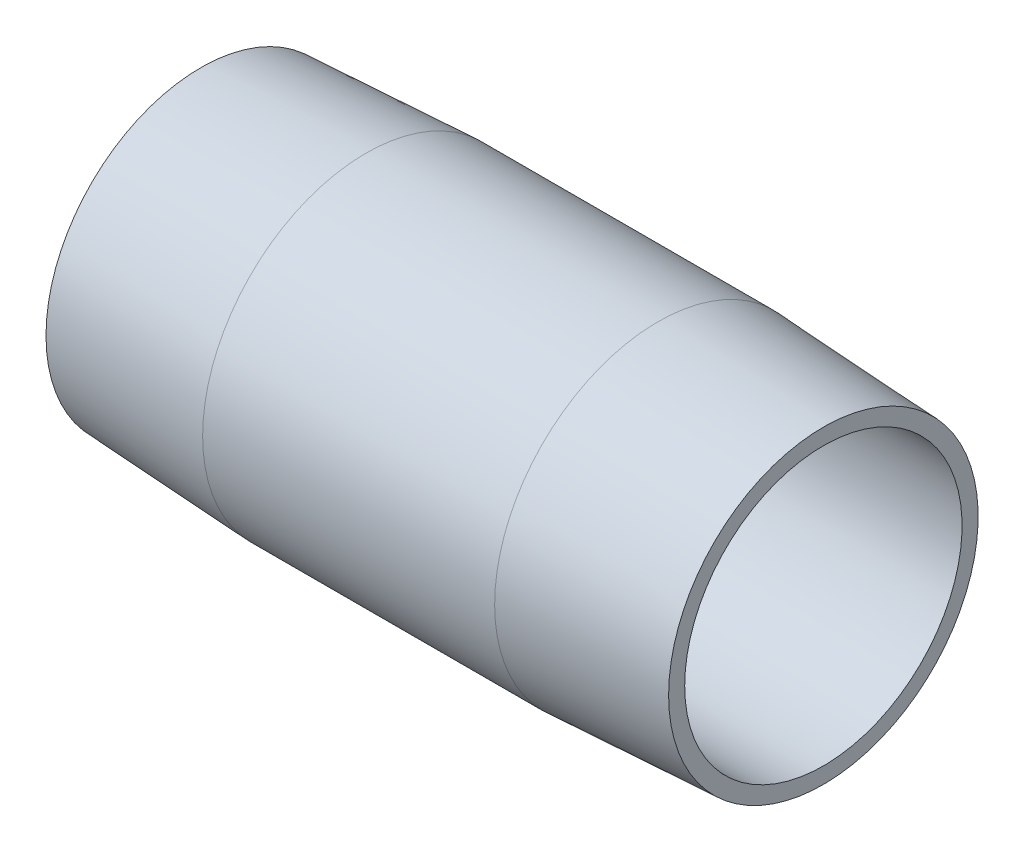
from build123d import *


with BuildPart() as part:
    # Sketch1 → Revolve1 (revolve)
    with BuildSketch(Plane(origin=(0, 0, 0), x_dir=(1, 0, 0), z_dir=(0, 1, 0)), mode=Mode.PRIVATE) as revolve1_sk:
        Polygon((50.8, 11.31567392), (0, 11.31567392), (0, 12.628129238), (13.4874, 13.33497392), (37.3126, 13.33497392), (50.8, 12.628129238), align=None)
    revolve(revolve1_sk.sketch.rotate(Axis((0, 0, 0), (1, 0, 0)), 180), axis=Axis((0, 0, 0), (1, 0, 0)))


solid = part.part
